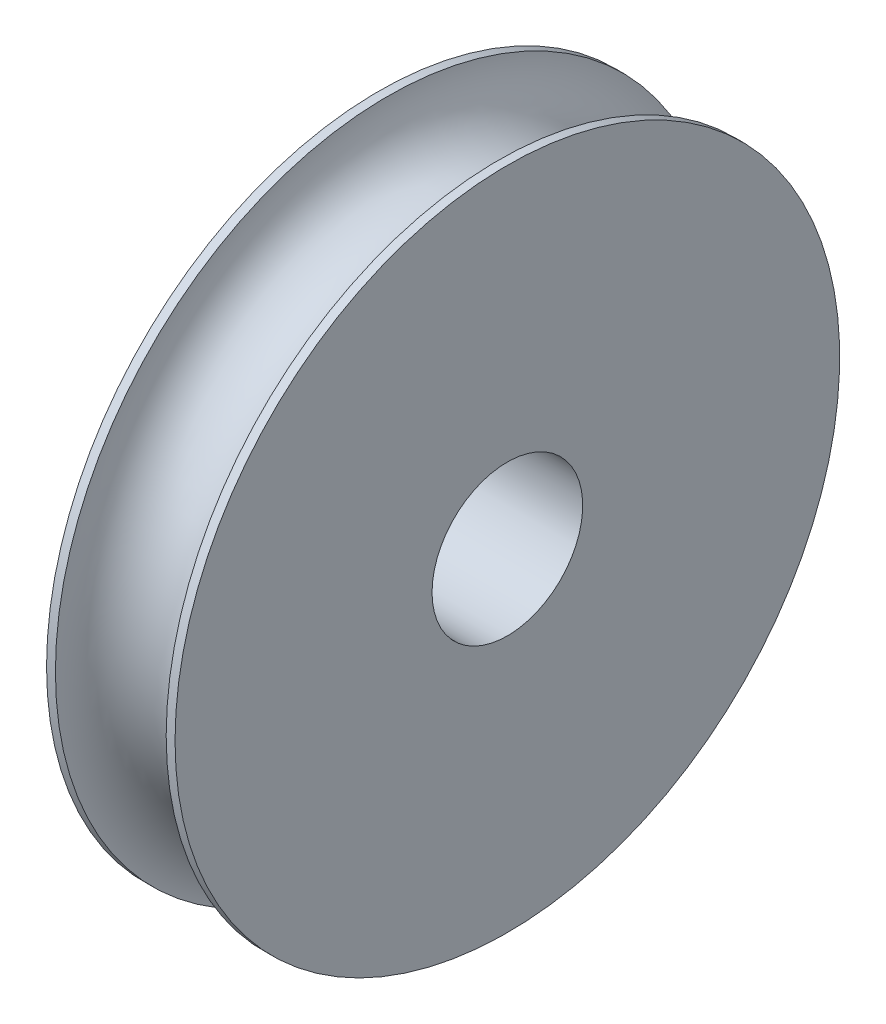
from build123d import *


with BuildPart() as part:
    # Esquisse1 → R_volution1 (revolve)
    with BuildSketch(Plane.XY, mode=Mode.PRIVATE) as r_volution1_sk:
        with BuildLine():
            Line((0, 17), (0, 75))
            Line((0, 75), (2, 75))
            ThreePointArc((2, 75), (14.5, 62.5), (27, 75))
            Line((27, 75), (29, 75))
            Line((29, 75), (29, 17))
            Line((29, 17), (0, 17))
        make_face()
    revolve(r_volution1_sk.sketch.rotate(Axis((0, 0, 0), (1, 0, 0)), 90), axis=Axis((0, 0, 0), (1, 0, 0)))


solid = part.part
